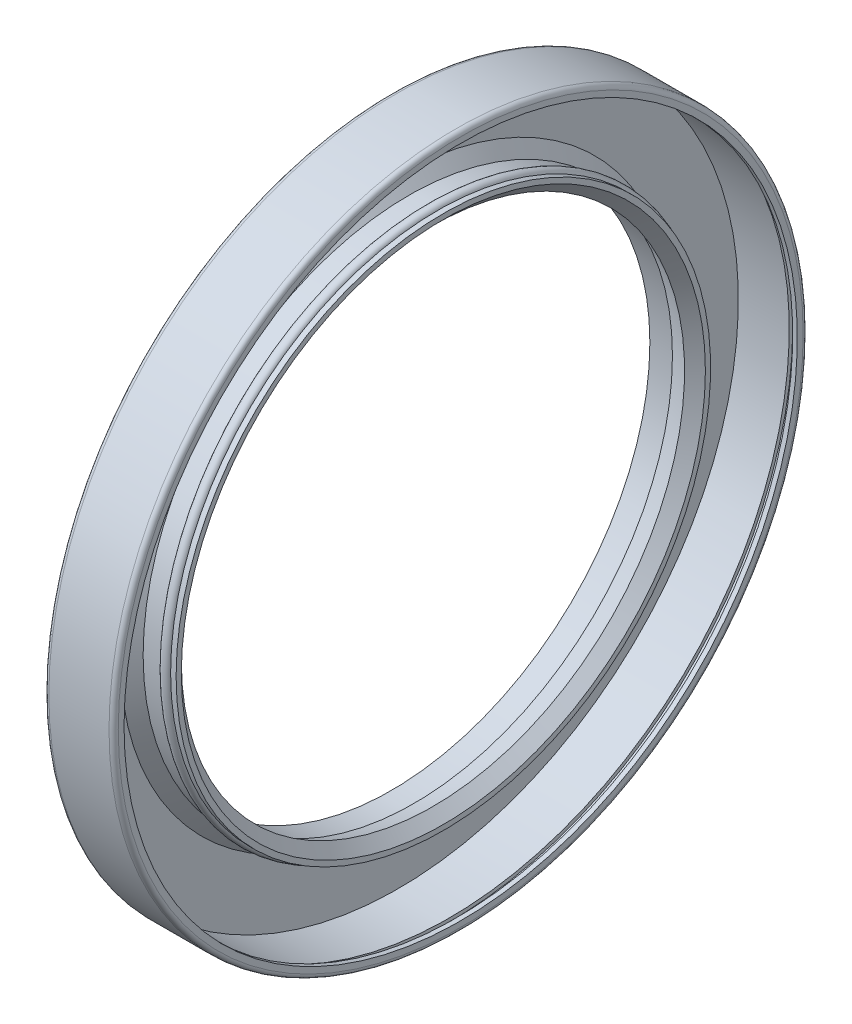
from build123d import *


with BuildPart() as part:
    # Esquisse1 → Base-R_volution (revolve)
    with BuildSketch(Plane(origin=(0, 0, 0), x_dir=(1, 0, 0), z_dir=(0, 1, 0)), mode=Mode.PRIVATE) as base_r_volution_sk:
        with BuildLine():
            Line((0, 29.8), (0, 39.466666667))
            ThreePointArc((0, 39.466666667), (0.156209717, 39.843790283), (0.533333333, 40))
            Line((0.533333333, 40), (7.466666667, 40))
            ThreePointArc((7.466666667, 40), (7.843790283, 39.843790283), (8, 39.466666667))
            Line((8, 39.466666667), (8, 38.8))
            Line((8, 38.8), (7.466666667, 38.8))
            Line((7.466666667, 38.8), (7.466666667, 39.6))
            Line((7.466666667, 39.6), (6.666666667, 39.6))
            Line((6.666666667, 39.6), (6.666666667, 39.2))
            Line((6.666666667, 39.2), (0.8, 39.2))
            Line((0.8, 39.2), (0.8, 32.030104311))
            Line((0.8, 32.030104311), (2, 30.6))
            Line((2, 30.6), (4.2, 30.6))
            ThreePointArc((4.2, 30.6), (4.698538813, 31.191359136), (5.365685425, 30.8))
            Line((5.365685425, 30.8), (6, 30.8))
            Line((6, 30.8), (6, 30.2))
            Line((6, 30.2), (4.8, 29))
            Line((4.8, 29), (2.602018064, 29.8))
            Line((2.602018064, 29.8), (0, 29.8))
        make_face()
    revolve(base_r_volution_sk.sketch.rotate(Axis((0, 0, 0), (1, 0, 0)), 180), axis=Axis((0, 0, 0), (1, 0, 0)))


solid = part.part
